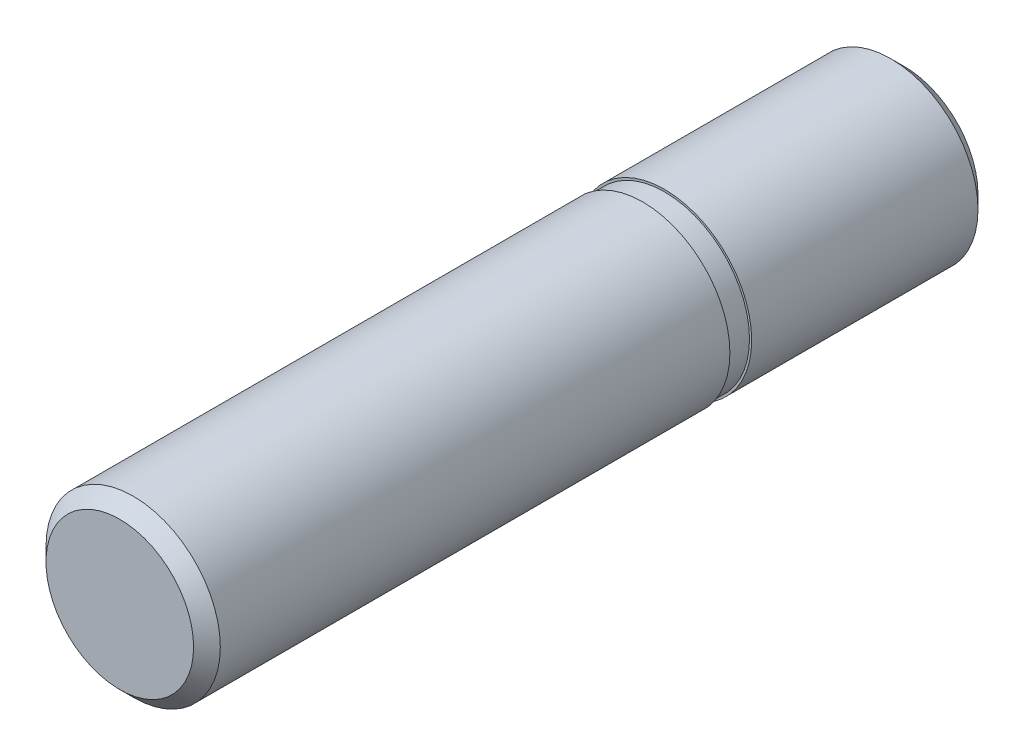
ISO-10303-21;
HEADER;
FILE_DESCRIPTION(('STEP AP214'),'2;1');
FILE_NAME('part.step','',(''),(''),'','','');
FILE_SCHEMA(('AUTOMOTIVE_DESIGN { 1 0 10303 214 1 1 1 1 }'));
ENDSEC;
DATA;
#1=APPLICATION_CONTEXT('core data for automotive mechanical design processes');
#2=APPLICATION_PROTOCOL_DEFINITION('international standard','automotive_design',2000,#1);
#3=PRODUCT_CONTEXT('',#1,'mechanical');
#4=PRODUCT('Part','Part','',(#3));
#5=PRODUCT_RELATED_PRODUCT_CATEGORY('part','',(#4));
#6=PRODUCT_DEFINITION_FORMATION('','',#4);
#7=PRODUCT_DEFINITION_CONTEXT('part definition',#1,'design');
#8=PRODUCT_DEFINITION('design','',#6,#7);
#9=PRODUCT_DEFINITION_SHAPE('','',#8);
#10=(LENGTH_UNIT() NAMED_UNIT(*) SI_UNIT(.MILLI.,.METRE.));
#11=(NAMED_UNIT(*) PLANE_ANGLE_UNIT() SI_UNIT($,.RADIAN.));
#12=(NAMED_UNIT(*) SI_UNIT($,.STERADIAN.) SOLID_ANGLE_UNIT());
#13=UNCERTAINTY_MEASURE_WITH_UNIT(LENGTH_MEASURE(1.E-05),#10,'distance_accuracy_value','');
#14=(GEOMETRIC_REPRESENTATION_CONTEXT(3) GLOBAL_UNCERTAINTY_ASSIGNED_CONTEXT((#13)) GLOBAL_UNIT_ASSIGNED_CONTEXT((#10,
#11,#12)) REPRESENTATION_CONTEXT('',''));
#15=CARTESIAN_POINT('',(0.,0.,0.));
#16=DIRECTION('',(0.,0.,1.));
#17=DIRECTION('',(1.,0.,0.));
#18=AXIS2_PLACEMENT_3D('',#15,#16,#17);
#19=CARTESIAN_POINT('',(0.,3.3865,-22.));
#20=DIRECTION('',(0.,0.,-1.));
#21=DIRECTION('',(-1.,0.,0.));
#22=AXIS2_PLACEMENT_3D('',#19,#20,#21);
#23=PLANE('',#22);
#24=CARTESIAN_POINT('',(0.,0.,-22.));
#25=DIRECTION('',(0.,0.,1.));
#26=DIRECTION('',(1.,0.,0.));
#27=AXIS2_PLACEMENT_3D('',#24,#25,#26);
#28=CIRCLE('',#27,6.773);
#29=CARTESIAN_POINT('',(6.773,0.,-22.));
#30=VERTEX_POINT('',#29);
#31=EDGE_CURVE('E19',#30,#30,#28,.T.);
#32=ORIENTED_EDGE('',*,*,#31,.F.);
#33=EDGE_LOOP('',(#32));
#34=FACE_BOUND('',#33,.T.);
#35=ADVANCED_FACE('F12',(#34),#23,.T.);
#36=CARTESIAN_POINT('',(0.,0.,-20.773));
#37=DIRECTION('',(0.,0.,1.));
#38=DIRECTION('',(1.,0.,0.));
#39=AXIS2_PLACEMENT_3D('',#36,#37,#38);
#40=CONICAL_SURFACE('',#39,8.,0.785398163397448);
#41=CARTESIAN_POINT('',(0.,0.,-20.773));
#42=DIRECTION('',(0.,0.,1.));
#43=DIRECTION('',(1.,0.,0.));
#44=AXIS2_PLACEMENT_3D('',#41,#42,#43);
#45=CIRCLE('',#44,8.);
#46=CARTESIAN_POINT('',(8.,0.,-20.773));
#47=VERTEX_POINT('',#46);
#48=EDGE_CURVE('E23',#47,#47,#45,.T.);
#49=ORIENTED_EDGE('',*,*,#48,.F.);
#50=EDGE_LOOP('',(#49));
#51=FACE_BOUND('',#50,.T.);
#52=ORIENTED_EDGE('',*,*,#31,.T.);
#53=EDGE_LOOP('',(#52));
#54=FACE_BOUND('',#53,.T.);
#55=ADVANCED_FACE('F66',(#51,#54),#40,.T.);
#56=CARTESIAN_POINT('',(0.,0.,5.));
#57=DIRECTION('',(0.,0.,1.));
#58=DIRECTION('',(1.,0.,0.));
#59=AXIS2_PLACEMENT_3D('',#56,#57,#58);
#60=CYLINDRICAL_SURFACE('',#59,8.);
#61=CARTESIAN_POINT('',(0.,0.,0.));
#62=DIRECTION('',(0.,0.,1.));
#63=DIRECTION('',(1.,0.,0.));
#64=AXIS2_PLACEMENT_3D('',#61,#62,#63);
#65=CIRCLE('',#64,8.);
#66=CARTESIAN_POINT('',(8.,0.,0.));
#67=VERTEX_POINT('',#66);
#68=EDGE_CURVE('E28',#67,#67,#65,.T.);
#69=ORIENTED_EDGE('',*,*,#68,.F.);
#70=EDGE_LOOP('',(#69));
#71=FACE_BOUND('',#70,.T.);
#72=ORIENTED_EDGE('',*,*,#48,.T.);
#73=EDGE_LOOP('',(#72));
#74=FACE_BOUND('',#73,.T.);
#75=ADVANCED_FACE('F72',(#71,#74),#60,.T.);
#76=CARTESIAN_POINT('',(0.,0.,0.));
#77=DIRECTION('',(0.,0.,1.));
#78=DIRECTION('',(1.,0.,0.));
#79=AXIS2_PLACEMENT_3D('',#76,#77,#78);
#80=PLANE('',#79);
#81=CARTESIAN_POINT('',(0.,0.,0.));
#82=DIRECTION('',(0.,0.,1.));
#83=DIRECTION('',(1.,0.,0.));
#84=AXIS2_PLACEMENT_3D('',#81,#82,#83);
#85=CIRCLE('',#84,7.8);
#86=CARTESIAN_POINT('',(7.8,0.,0.));
#87=VERTEX_POINT('',#86);
#88=EDGE_CURVE('E8',#87,#87,#85,.T.);
#89=ORIENTED_EDGE('',*,*,#88,.F.);
#90=EDGE_LOOP('',(#89));
#91=FACE_BOUND('',#90,.T.);
#92=ORIENTED_EDGE('',*,*,#68,.T.);
#93=EDGE_LOOP('',(#92));
#94=FACE_BOUND('',#93,.T.);
#95=ADVANCED_FACE('F77',(#91,#94),#80,.T.);
#96=CARTESIAN_POINT('',(0.,0.,-5.81071817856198));
#97=DIRECTION('',(0.,0.,-1.));
#98=DIRECTION('',(-1.,0.,0.));
#99=AXIS2_PLACEMENT_3D('',#96,#97,#98);
#100=CYLINDRICAL_SURFACE('',#99,7.8);
#101=CARTESIAN_POINT('',(0.,0.,2.));
#102=DIRECTION('',(0.,0.,-1.));
#103=DIRECTION('',(-1.,0.,0.));
#104=AXIS2_PLACEMENT_3D('',#101,#102,#103);
#105=CIRCLE('',#104,7.8);
#106=CARTESIAN_POINT('',(-7.8,0.,2.));
#107=VERTEX_POINT('',#106);
#108=EDGE_CURVE('E44',#107,#107,#105,.T.);
#109=ORIENTED_EDGE('',*,*,#108,.T.);
#110=EDGE_LOOP('',(#109));
#111=FACE_BOUND('',#110,.T.);
#112=ORIENTED_EDGE('',*,*,#88,.T.);
#113=EDGE_LOOP('',(#112));
#114=FACE_BOUND('',#113,.T.);
#115=ADVANCED_FACE('F51',(#111,#114),#100,.T.);
#116=CARTESIAN_POINT('',(0.,0.,50.));
#117=DIRECTION('',(0.,0.,1.));
#118=DIRECTION('',(1.,0.,0.));
#119=AXIS2_PLACEMENT_3D('',#116,#117,#118);
#120=PLANE('',#119);
#121=CARTESIAN_POINT('',(0.,0.,50.));
#122=DIRECTION('',(0.,0.,1.));
#123=DIRECTION('',(1.,0.,0.));
#124=AXIS2_PLACEMENT_3D('',#121,#122,#123);
#125=CIRCLE('',#124,6.773);
#126=CARTESIAN_POINT('',(6.773,0.,50.));
#127=VERTEX_POINT('',#126);
#128=EDGE_CURVE('E40',#127,#127,#125,.T.);
#129=ORIENTED_EDGE('',*,*,#128,.T.);
#130=EDGE_LOOP('',(#129));
#131=FACE_BOUND('',#130,.T.);
#132=ADVANCED_FACE('F85',(#131),#120,.T.);
#133=CARTESIAN_POINT('',(0.,0.,50.));
#134=DIRECTION('',(0.,0.,-1.));
#135=DIRECTION('',(-1.,0.,0.));
#136=AXIS2_PLACEMENT_3D('',#133,#134,#135);
#137=CONICAL_SURFACE('',#136,6.773,0.785398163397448);
#138=CARTESIAN_POINT('',(0.,0.,48.773));
#139=DIRECTION('',(0.,0.,1.));
#140=DIRECTION('',(1.,0.,0.));
#141=AXIS2_PLACEMENT_3D('',#138,#139,#140);
#142=CIRCLE('',#141,8.);
#143=CARTESIAN_POINT('',(8.,0.,48.773));
#144=VERTEX_POINT('',#143);
#145=EDGE_CURVE('E31',#144,#144,#142,.F.);
#146=ORIENTED_EDGE('',*,*,#145,.F.);
#147=EDGE_LOOP('',(#146));
#148=FACE_BOUND('',#147,.T.);
#149=ORIENTED_EDGE('',*,*,#128,.F.);
#150=EDGE_LOOP('',(#149));
#151=FACE_BOUND('',#150,.T.);
#152=ADVANCED_FACE('F62',(#148,#151),#137,.T.);
#153=CARTESIAN_POINT('',(0.,0.,5.));
#154=DIRECTION('',(0.,0.,1.));
#155=DIRECTION('',(1.,0.,0.));
#156=AXIS2_PLACEMENT_3D('',#153,#154,#155);
#157=CYLINDRICAL_SURFACE('',#156,8.);
#158=CARTESIAN_POINT('',(0.,0.,2.));
#159=DIRECTION('',(0.,0.,1.));
#160=DIRECTION('',(1.,0.,0.));
#161=AXIS2_PLACEMENT_3D('',#158,#159,#160);
#162=CIRCLE('',#161,8.);
#163=CARTESIAN_POINT('',(8.,0.,2.));
#164=VERTEX_POINT('',#163);
#165=EDGE_CURVE('E35',#164,#164,#162,.T.);
#166=ORIENTED_EDGE('',*,*,#165,.T.);
#167=EDGE_LOOP('',(#166));
#168=FACE_BOUND('',#167,.T.);
#169=ORIENTED_EDGE('',*,*,#145,.T.);
#170=EDGE_LOOP('',(#169));
#171=FACE_BOUND('',#170,.T.);
#172=ADVANCED_FACE('F14',(#168,#171),#157,.T.);
#173=CARTESIAN_POINT('',(0.,0.,2.));
#174=DIRECTION('',(0.,0.,1.));
#175=DIRECTION('',(1.,0.,0.));
#176=AXIS2_PLACEMENT_3D('',#173,#174,#175);
#177=PLANE('',#176);
#178=ORIENTED_EDGE('',*,*,#108,.F.);
#179=EDGE_LOOP('',(#178));
#180=FACE_BOUND('',#179,.T.);
#181=ORIENTED_EDGE('',*,*,#165,.F.);
#182=EDGE_LOOP('',(#181));
#183=FACE_BOUND('',#182,.T.);
#184=ADVANCED_FACE('F53',(#180,#183),#177,.F.);
#185=CLOSED_SHELL('',(#35,#55,#75,#95,#115,#132,#152,#172,#184));
#186=MANIFOLD_SOLID_BREP('B1',#185);
#187=ADVANCED_BREP_SHAPE_REPRESENTATION('',(#18,#186),#14);
#188=SHAPE_DEFINITION_REPRESENTATION(#9,#187);
ENDSEC;
END-ISO-10303-21;
